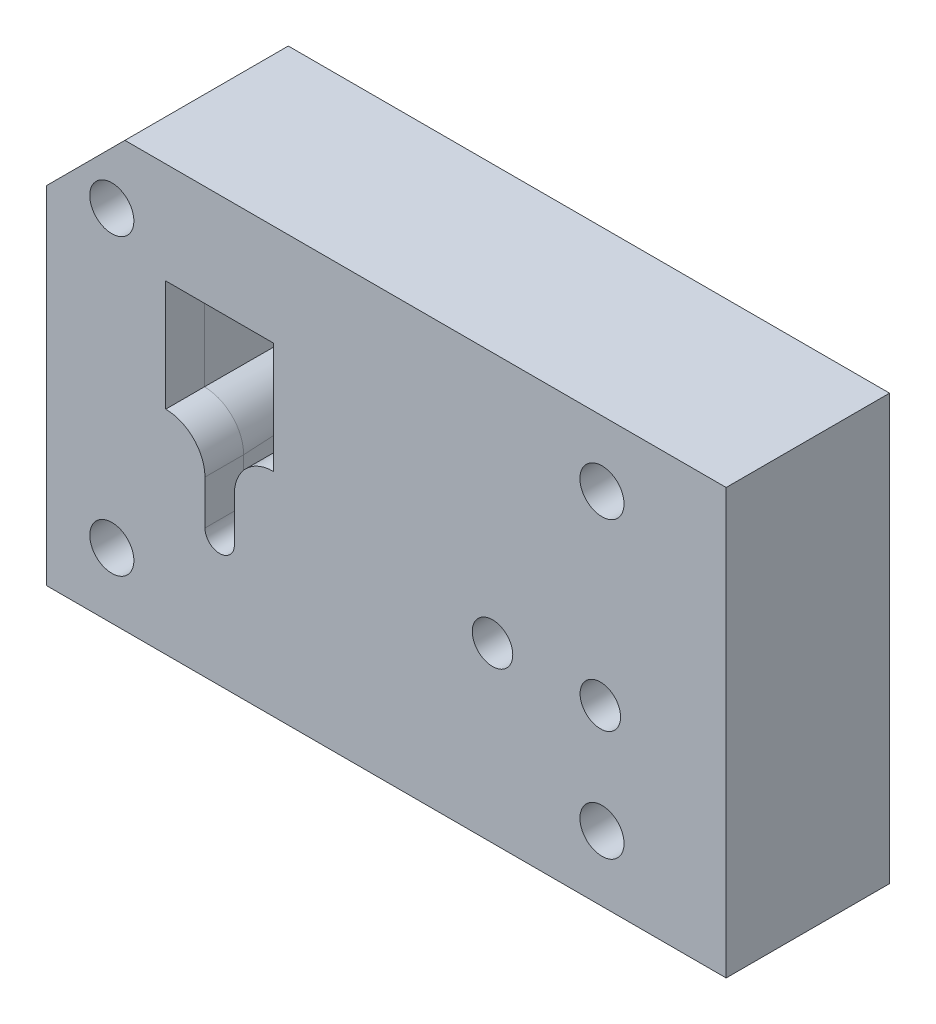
ISO-10303-21;
HEADER;
FILE_DESCRIPTION(('STEP AP214'),'2;1');
FILE_NAME('part.step','',(''),(''),'','','');
FILE_SCHEMA(('AUTOMOTIVE_DESIGN { 1 0 10303 214 1 1 1 1 }'));
ENDSEC;
DATA;
#1=APPLICATION_CONTEXT('core data for automotive mechanical design processes');
#2=APPLICATION_PROTOCOL_DEFINITION('international standard','automotive_design',2000,#1);
#3=PRODUCT_CONTEXT('',#1,'mechanical');
#4=PRODUCT('Part','Part','',(#3));
#5=PRODUCT_RELATED_PRODUCT_CATEGORY('part','',(#4));
#6=PRODUCT_DEFINITION_FORMATION('','',#4);
#7=PRODUCT_DEFINITION_CONTEXT('part definition',#1,'design');
#8=PRODUCT_DEFINITION('design','',#6,#7);
#9=PRODUCT_DEFINITION_SHAPE('','',#8);
#10=(LENGTH_UNIT() NAMED_UNIT(*) SI_UNIT(.MILLI.,.METRE.));
#11=(NAMED_UNIT(*) PLANE_ANGLE_UNIT() SI_UNIT($,.RADIAN.));
#12=(NAMED_UNIT(*) SI_UNIT($,.STERADIAN.) SOLID_ANGLE_UNIT());
#13=UNCERTAINTY_MEASURE_WITH_UNIT(LENGTH_MEASURE(1.E-05),#10,'distance_accuracy_value','');
#14=(GEOMETRIC_REPRESENTATION_CONTEXT(3) GLOBAL_UNCERTAINTY_ASSIGNED_CONTEXT((#13)) GLOBAL_UNIT_ASSIGNED_CONTEXT((#10,
#11,#12)) REPRESENTATION_CONTEXT('',''));
#15=CARTESIAN_POINT('',(0.,0.,0.));
#16=DIRECTION('',(0.,0.,1.));
#17=DIRECTION('',(1.,0.,0.));
#18=AXIS2_PLACEMENT_3D('',#15,#16,#17);
#19=CARTESIAN_POINT('',(205.,122.,25.));
#20=DIRECTION('',(0.,0.,1.));
#21=DIRECTION('',(1.,0.,0.));
#22=AXIS2_PLACEMENT_3D('',#19,#20,#21);
#23=PLANE('',#22);
#24=CARTESIAN_POINT('',(186.,132.,25.));
#25=DIRECTION('',(0.,0.,-1.));
#26=DIRECTION('',(-1.,0.,0.));
#27=AXIS2_PLACEMENT_3D('',#24,#25,#26);
#28=CIRCLE('',#27,3.375);
#29=CARTESIAN_POINT('',(182.625,132.,25.));
#30=VERTEX_POINT('',#29);
#31=EDGE_CURVE('E440',#30,#30,#28,.T.);
#32=ORIENTED_EDGE('',*,*,#31,.T.);
#33=EDGE_LOOP('',(#32));
#34=FACE_BOUND('',#33,.T.);
#35=CARTESIAN_POINT('',(186.,177.,25.));
#36=DIRECTION('',(0.,0.,-1.));
#37=DIRECTION('',(-1.,0.,0.));
#38=AXIS2_PLACEMENT_3D('',#35,#36,#37);
#39=CIRCLE('',#38,3.375);
#40=CARTESIAN_POINT('',(182.625,177.,25.));
#41=VERTEX_POINT('',#40);
#42=EDGE_CURVE('E450',#41,#41,#39,.T.);
#43=ORIENTED_EDGE('',*,*,#42,.T.);
#44=EDGE_LOOP('',(#43));
#45=FACE_BOUND('',#44,.T.);
#46=CARTESIAN_POINT('',(111.,132.,25.));
#47=DIRECTION('',(0.,0.,-1.));
#48=DIRECTION('',(-1.,0.,0.));
#49=AXIS2_PLACEMENT_3D('',#46,#47,#48);
#50=CIRCLE('',#49,3.375);
#51=CARTESIAN_POINT('',(107.625,132.,25.));
#52=VERTEX_POINT('',#51);
#53=EDGE_CURVE('E456',#52,#52,#50,.T.);
#54=ORIENTED_EDGE('',*,*,#53,.T.);
#55=EDGE_LOOP('',(#54));
#56=FACE_BOUND('',#55,.T.);
#57=CARTESIAN_POINT('',(111.,177.,25.));
#58=DIRECTION('',(0.,0.,-1.));
#59=DIRECTION('',(-1.,0.,0.));
#60=AXIS2_PLACEMENT_3D('',#57,#58,#59);
#61=CIRCLE('',#60,3.375);
#62=CARTESIAN_POINT('',(107.625,177.,25.));
#63=VERTEX_POINT('',#62);
#64=EDGE_CURVE('E462',#63,#63,#61,.T.);
#65=ORIENTED_EDGE('',*,*,#64,.T.);
#66=EDGE_LOOP('',(#65));
#67=FACE_BOUND('',#66,.T.);
#68=CARTESIAN_POINT('',(169.25,148.5,25.));
#69=DIRECTION('',(0.,0.,1.));
#70=DIRECTION('',(1.,0.,0.));
#71=AXIS2_PLACEMENT_3D('',#68,#69,#70);
#72=CIRCLE('',#71,3.10000000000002);
#73=CARTESIAN_POINT('',(172.35,148.5,25.));
#74=VERTEX_POINT('',#73);
#75=EDGE_CURVE('E279',#74,#74,#72,.T.);
#76=ORIENTED_EDGE('',*,*,#75,.F.);
#77=EDGE_LOOP('',(#76));
#78=FACE_BOUND('',#77,.T.);
#79=DIRECTION('',(0.,1.,0.));
#80=VECTOR('',#79,1.);
#81=CARTESIAN_POINT('',(205.,187.,25.));
#82=LINE('',#81,#80);
#83=CARTESIAN_POINT('',(205.,122.,25.));
#84=VERTEX_POINT('',#83);
#85=CARTESIAN_POINT('',(205.,187.,25.));
#86=VERTEX_POINT('',#85);
#87=EDGE_CURVE('E299',#84,#86,#82,.T.);
#88=ORIENTED_EDGE('',*,*,#87,.T.);
#89=DIRECTION('',(-1.,0.,0.));
#90=VECTOR('',#89,1.);
#91=CARTESIAN_POINT('',(205.,187.,25.));
#92=LINE('',#91,#90);
#93=CARTESIAN_POINT('',(113.,187.,25.));
#94=VERTEX_POINT('',#93);
#95=EDGE_CURVE('E302',#86,#94,#92,.T.);
#96=ORIENTED_EDGE('',*,*,#95,.T.);
#97=DIRECTION('',(-0.707106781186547,-0.707106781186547,0.));
#98=VECTOR('',#97,1.);
#99=CARTESIAN_POINT('',(113.,187.,25.));
#100=LINE('',#99,#98);
#101=CARTESIAN_POINT('',(101.,175.,25.));
#102=VERTEX_POINT('',#101);
#103=EDGE_CURVE('E304',#94,#102,#100,.T.);
#104=ORIENTED_EDGE('',*,*,#103,.T.);
#105=DIRECTION('',(0.,-1.,0.));
#106=VECTOR('',#105,1.);
#107=CARTESIAN_POINT('',(101.,175.,25.));
#108=LINE('',#107,#106);
#109=CARTESIAN_POINT('',(101.,122.,25.));
#110=VERTEX_POINT('',#109);
#111=EDGE_CURVE('E306',#102,#110,#108,.T.);
#112=ORIENTED_EDGE('',*,*,#111,.T.);
#113=DIRECTION('',(1.,0.,0.));
#114=VECTOR('',#113,1.);
#115=CARTESIAN_POINT('',(101.,122.,25.));
#116=LINE('',#115,#114);
#117=EDGE_CURVE('E308',#110,#84,#116,.T.);
#118=ORIENTED_EDGE('',*,*,#117,.T.);
#119=EDGE_LOOP('',(#88,#96,#104,#112,#118));
#120=FACE_BOUND('',#119,.T.);
#121=CARTESIAN_POINT('',(185.75,148.5,25.));
#122=DIRECTION('',(0.,0.,1.));
#123=DIRECTION('',(1.,0.,0.));
#124=AXIS2_PLACEMENT_3D('',#121,#122,#123);
#125=CIRCLE('',#124,3.09999999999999);
#126=CARTESIAN_POINT('',(188.85,148.5,25.));
#127=VERTEX_POINT('',#126);
#128=EDGE_CURVE('E285',#127,#127,#125,.T.);
#129=ORIENTED_EDGE('',*,*,#128,.F.);
#130=EDGE_LOOP('',(#129));
#131=FACE_BOUND('',#130,.T.);
#132=DIRECTION('',(0.,1.,0.));
#133=VECTOR('',#132,1.);
#134=CARTESIAN_POINT('',(135.75,154.5,25.));
#135=LINE('',#134,#133);
#136=CARTESIAN_POINT('',(135.75,154.5,25.));
#137=VERTEX_POINT('',#136);
#138=CARTESIAN_POINT('',(135.75,171.5,25.));
#139=VERTEX_POINT('',#138);
#140=EDGE_CURVE('E237',#137,#139,#135,.T.);
#141=ORIENTED_EDGE('',*,*,#140,.F.);
#142=CARTESIAN_POINT('',(135.75,148.5,25.));
#143=DIRECTION('',(0.,0.,-1.));
#144=DIRECTION('',(1.,0.,0.));
#145=AXIS2_PLACEMENT_3D('',#142,#143,#144);
#146=CIRCLE('',#145,6.00000000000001);
#147=CARTESIAN_POINT('',(129.75,148.5,25.));
#148=VERTEX_POINT('',#147);
#149=EDGE_CURVE('E235',#148,#137,#146,.T.);
#150=ORIENTED_EDGE('',*,*,#149,.F.);
#151=DIRECTION('',(0.,1.,0.));
#152=VECTOR('',#151,1.);
#153=CARTESIAN_POINT('',(129.75,148.5,25.));
#154=LINE('',#153,#152);
#155=CARTESIAN_POINT('',(129.75,141.75,25.));
#156=VERTEX_POINT('',#155);
#157=EDGE_CURVE('E250',#156,#148,#154,.T.);
#158=ORIENTED_EDGE('',*,*,#157,.F.);
#159=CARTESIAN_POINT('',(127.5,141.75,25.));
#160=DIRECTION('',(0.,0.,1.));
#161=DIRECTION('',(1.,0.,0.));
#162=AXIS2_PLACEMENT_3D('',#159,#160,#161);
#163=CIRCLE('',#162,2.25);
#164=CARTESIAN_POINT('',(125.25,141.75,25.));
#165=VERTEX_POINT('',#164);
#166=EDGE_CURVE('E247',#165,#156,#163,.T.);
#167=ORIENTED_EDGE('',*,*,#166,.F.);
#168=DIRECTION('',(0.,-1.,0.));
#169=VECTOR('',#168,1.);
#170=CARTESIAN_POINT('',(125.25,141.75,25.));
#171=LINE('',#170,#169);
#172=CARTESIAN_POINT('',(125.25,148.5,25.));
#173=VERTEX_POINT('',#172);
#174=EDGE_CURVE('E245',#173,#165,#171,.T.);
#175=ORIENTED_EDGE('',*,*,#174,.F.);
#176=CARTESIAN_POINT('',(119.25,148.5,25.));
#177=DIRECTION('',(0.,0.,-1.));
#178=DIRECTION('',(1.,0.,0.));
#179=AXIS2_PLACEMENT_3D('',#176,#177,#178);
#180=CIRCLE('',#179,5.99999999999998);
#181=CARTESIAN_POINT('',(119.25,154.5,25.));
#182=VERTEX_POINT('',#181);
#183=EDGE_CURVE('E243',#182,#173,#180,.T.);
#184=ORIENTED_EDGE('',*,*,#183,.F.);
#185=DIRECTION('',(0.,-1.,0.));
#186=VECTOR('',#185,1.);
#187=CARTESIAN_POINT('',(119.25,171.5,25.));
#188=LINE('',#187,#186);
#189=CARTESIAN_POINT('',(119.25,171.5,25.));
#190=VERTEX_POINT('',#189);
#191=EDGE_CURVE('E241',#190,#182,#188,.T.);
#192=ORIENTED_EDGE('',*,*,#191,.F.);
#193=DIRECTION('',(-1.,0.,0.));
#194=VECTOR('',#193,1.);
#195=CARTESIAN_POINT('',(135.75,171.5,25.));
#196=LINE('',#195,#194);
#197=EDGE_CURVE('E239',#139,#190,#196,.T.);
#198=ORIENTED_EDGE('',*,*,#197,.F.);
#199=EDGE_LOOP('',(#141,#150,#158,#167,#175,#184,#192,#198));
#200=FACE_BOUND('',#199,.T.);
#201=ADVANCED_FACE('F31',(#34,#45,#56,#67,#78,#120,#131,#200),#23,.T.);
#202=CARTESIAN_POINT('',(205.,122.,0.));
#203=DIRECTION('',(0.,0.,1.));
#204=DIRECTION('',(1.,0.,0.));
#205=AXIS2_PLACEMENT_3D('',#202,#203,#204);
#206=PLANE('',#205);
#207=CARTESIAN_POINT('',(186.,132.,0.));
#208=DIRECTION('',(0.,0.,-1.));
#209=DIRECTION('',(-1.,0.,0.));
#210=AXIS2_PLACEMENT_3D('',#207,#208,#209);
#211=CIRCLE('',#210,3.375);
#212=CARTESIAN_POINT('',(182.625,132.,0.));
#213=VERTEX_POINT('',#212);
#214=EDGE_CURVE('E443',#213,#213,#211,.T.);
#215=ORIENTED_EDGE('',*,*,#214,.F.);
#216=EDGE_LOOP('',(#215));
#217=FACE_BOUND('',#216,.T.);
#218=CARTESIAN_POINT('',(186.,177.,0.));
#219=DIRECTION('',(0.,0.,-1.));
#220=DIRECTION('',(-1.,0.,0.));
#221=AXIS2_PLACEMENT_3D('',#218,#219,#220);
#222=CIRCLE('',#221,3.375);
#223=CARTESIAN_POINT('',(182.625,177.,0.));
#224=VERTEX_POINT('',#223);
#225=EDGE_CURVE('E445',#224,#224,#222,.T.);
#226=ORIENTED_EDGE('',*,*,#225,.F.);
#227=EDGE_LOOP('',(#226));
#228=FACE_BOUND('',#227,.T.);
#229=CARTESIAN_POINT('',(111.,132.,0.));
#230=DIRECTION('',(0.,0.,-1.));
#231=DIRECTION('',(-1.,0.,0.));
#232=AXIS2_PLACEMENT_3D('',#229,#230,#231);
#233=CIRCLE('',#232,3.375);
#234=CARTESIAN_POINT('',(107.625,132.,0.));
#235=VERTEX_POINT('',#234);
#236=EDGE_CURVE('E453',#235,#235,#233,.T.);
#237=ORIENTED_EDGE('',*,*,#236,.F.);
#238=EDGE_LOOP('',(#237));
#239=FACE_BOUND('',#238,.T.);
#240=CARTESIAN_POINT('',(111.,177.,0.));
#241=DIRECTION('',(0.,0.,-1.));
#242=DIRECTION('',(-1.,0.,0.));
#243=AXIS2_PLACEMENT_3D('',#240,#241,#242);
#244=CIRCLE('',#243,3.375);
#245=CARTESIAN_POINT('',(107.625,177.,0.));
#246=VERTEX_POINT('',#245);
#247=EDGE_CURVE('E459',#246,#246,#244,.T.);
#248=ORIENTED_EDGE('',*,*,#247,.F.);
#249=EDGE_LOOP('',(#248));
#250=FACE_BOUND('',#249,.T.);
#251=DIRECTION('',(1.,0.,0.));
#252=VECTOR('',#251,1.);
#253=CARTESIAN_POINT('',(118.25,172.5,0.));
#254=LINE('',#253,#252);
#255=CARTESIAN_POINT('',(118.25,172.5,0.));
#256=VERTEX_POINT('',#255);
#257=CARTESIAN_POINT('',(136.75,172.5,0.));
#258=VERTEX_POINT('',#257);
#259=EDGE_CURVE('E165',#256,#258,#254,.T.);
#260=ORIENTED_EDGE('',*,*,#259,.F.);
#261=DIRECTION('',(0.,1.,0.));
#262=VECTOR('',#261,1.);
#263=CARTESIAN_POINT('',(118.25,153.398979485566,0.));
#264=LINE('',#263,#262);
#265=CARTESIAN_POINT('',(118.25,153.398979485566,0.));
#266=VERTEX_POINT('',#265);
#267=EDGE_CURVE('E46',#266,#256,#264,.T.);
#268=ORIENTED_EDGE('',*,*,#267,.F.);
#269=CARTESIAN_POINT('',(119.25,148.5,0.));
#270=DIRECTION('',(0.,0.,1.));
#271=DIRECTION('',(-1.,0.,0.));
#272=AXIS2_PLACEMENT_3D('',#269,#270,#271);
#273=CIRCLE('',#272,4.99999999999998);
#274=CARTESIAN_POINT('',(124.25,148.5,0.));
#275=VERTEX_POINT('',#274);
#276=EDGE_CURVE('E186',#275,#266,#273,.T.);
#277=ORIENTED_EDGE('',*,*,#276,.F.);
#278=DIRECTION('',(0.,1.,0.));
#279=VECTOR('',#278,1.);
#280=CARTESIAN_POINT('',(124.25,141.75,0.));
#281=LINE('',#280,#279);
#282=CARTESIAN_POINT('',(124.25,141.75,0.));
#283=VERTEX_POINT('',#282);
#284=EDGE_CURVE('E183',#283,#275,#281,.T.);
#285=ORIENTED_EDGE('',*,*,#284,.F.);
#286=CARTESIAN_POINT('',(127.5,141.75,0.));
#287=DIRECTION('',(0.,0.,-1.));
#288=DIRECTION('',(-1.,0.,0.));
#289=AXIS2_PLACEMENT_3D('',#286,#287,#288);
#290=CIRCLE('',#289,3.25000000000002);
#291=CARTESIAN_POINT('',(130.75,141.75,0.));
#292=VERTEX_POINT('',#291);
#293=EDGE_CURVE('E180',#292,#283,#290,.T.);
#294=ORIENTED_EDGE('',*,*,#293,.F.);
#295=DIRECTION('',(0.,-1.,0.));
#296=VECTOR('',#295,1.);
#297=CARTESIAN_POINT('',(130.75,148.5,0.));
#298=LINE('',#297,#296);
#299=CARTESIAN_POINT('',(130.75,148.5,0.));
#300=VERTEX_POINT('',#299);
#301=EDGE_CURVE('E175',#300,#292,#298,.T.);
#302=ORIENTED_EDGE('',*,*,#301,.F.);
#303=CARTESIAN_POINT('',(135.75,148.5,0.));
#304=DIRECTION('',(0.,0.,1.));
#305=DIRECTION('',(-1.,0.,0.));
#306=AXIS2_PLACEMENT_3D('',#303,#304,#305);
#307=CIRCLE('',#306,4.99999999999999);
#308=CARTESIAN_POINT('',(136.75,153.398979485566,0.));
#309=VERTEX_POINT('',#308);
#310=EDGE_CURVE('E173',#309,#300,#307,.T.);
#311=ORIENTED_EDGE('',*,*,#310,.F.);
#312=DIRECTION('',(0.,-1.,0.));
#313=VECTOR('',#312,1.);
#314=CARTESIAN_POINT('',(136.75,172.5,0.));
#315=LINE('',#314,#313);
#316=EDGE_CURVE('E155',#258,#309,#315,.T.);
#317=ORIENTED_EDGE('',*,*,#316,.F.);
#318=EDGE_LOOP('',(#260,#268,#277,#285,#294,#302,#311,#317));
#319=FACE_BOUND('',#318,.T.);
#320=CARTESIAN_POINT('',(169.25,148.5,0.));
#321=DIRECTION('',(0.,0.,1.));
#322=DIRECTION('',(1.,0.,0.));
#323=AXIS2_PLACEMENT_3D('',#320,#321,#322);
#324=CIRCLE('',#323,3.10000000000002);
#325=CARTESIAN_POINT('',(172.35,148.5,0.));
#326=VERTEX_POINT('',#325);
#327=EDGE_CURVE('E276',#326,#326,#324,.T.);
#328=ORIENTED_EDGE('',*,*,#327,.T.);
#329=EDGE_LOOP('',(#328));
#330=FACE_BOUND('',#329,.T.);
#331=DIRECTION('',(0.,1.,0.));
#332=VECTOR('',#331,1.);
#333=CARTESIAN_POINT('',(205.,187.,0.));
#334=LINE('',#333,#332);
#335=CARTESIAN_POINT('',(205.,122.,0.));
#336=VERTEX_POINT('',#335);
#337=CARTESIAN_POINT('',(205.,187.,0.));
#338=VERTEX_POINT('',#337);
#339=EDGE_CURVE('E288',#336,#338,#334,.T.);
#340=ORIENTED_EDGE('',*,*,#339,.F.);
#341=DIRECTION('',(1.,0.,0.));
#342=VECTOR('',#341,1.);
#343=CARTESIAN_POINT('',(101.,122.,0.));
#344=LINE('',#343,#342);
#345=CARTESIAN_POINT('',(101.,122.,0.));
#346=VERTEX_POINT('',#345);
#347=EDGE_CURVE('E297',#346,#336,#344,.T.);
#348=ORIENTED_EDGE('',*,*,#347,.F.);
#349=DIRECTION('',(0.,-1.,0.));
#350=VECTOR('',#349,1.);
#351=CARTESIAN_POINT('',(101.,175.,0.));
#352=LINE('',#351,#350);
#353=CARTESIAN_POINT('',(101.,175.,0.));
#354=VERTEX_POINT('',#353);
#355=EDGE_CURVE('E295',#354,#346,#352,.T.);
#356=ORIENTED_EDGE('',*,*,#355,.F.);
#357=DIRECTION('',(-0.707106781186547,-0.707106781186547,0.));
#358=VECTOR('',#357,1.);
#359=CARTESIAN_POINT('',(113.,187.,0.));
#360=LINE('',#359,#358);
#361=CARTESIAN_POINT('',(113.,187.,0.));
#362=VERTEX_POINT('',#361);
#363=EDGE_CURVE('E293',#362,#354,#360,.T.);
#364=ORIENTED_EDGE('',*,*,#363,.F.);
#365=DIRECTION('',(-1.,0.,0.));
#366=VECTOR('',#365,1.);
#367=CARTESIAN_POINT('',(205.,187.,0.));
#368=LINE('',#367,#366);
#369=EDGE_CURVE('E291',#338,#362,#368,.T.);
#370=ORIENTED_EDGE('',*,*,#369,.F.);
#371=EDGE_LOOP('',(#340,#348,#356,#364,#370));
#372=FACE_BOUND('',#371,.T.);
#373=CARTESIAN_POINT('',(185.75,148.5,0.));
#374=DIRECTION('',(0.,0.,1.));
#375=DIRECTION('',(1.,0.,0.));
#376=AXIS2_PLACEMENT_3D('',#373,#374,#375);
#377=CIRCLE('',#376,3.09999999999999);
#378=CARTESIAN_POINT('',(188.85,148.5,0.));
#379=VERTEX_POINT('',#378);
#380=EDGE_CURVE('E282',#379,#379,#377,.T.);
#381=ORIENTED_EDGE('',*,*,#380,.T.);
#382=EDGE_LOOP('',(#381));
#383=FACE_BOUND('',#382,.T.);
#384=ADVANCED_FACE('F169',(#217,#228,#239,#250,#319,#330,#372,#383),#206,.F.);
#385=CARTESIAN_POINT('',(205.,187.,25.));
#386=DIRECTION('',(-1.,0.,0.));
#387=DIRECTION('',(0.,0.,1.));
#388=AXIS2_PLACEMENT_3D('',#385,#386,#387);
#389=PLANE('',#388);
#390=ORIENTED_EDGE('',*,*,#339,.T.);
#391=DIRECTION('',(0.,0.,-1.));
#392=VECTOR('',#391,1.);
#393=CARTESIAN_POINT('',(205.,187.,25.));
#394=LINE('',#393,#392);
#395=EDGE_CURVE('E39',#86,#338,#394,.T.);
#396=ORIENTED_EDGE('',*,*,#395,.F.);
#397=ORIENTED_EDGE('',*,*,#87,.F.);
#398=DIRECTION('',(0.,0.,-1.));
#399=VECTOR('',#398,1.);
#400=CARTESIAN_POINT('',(205.,122.,25.));
#401=LINE('',#400,#399);
#402=EDGE_CURVE('E310',#84,#336,#401,.T.);
#403=ORIENTED_EDGE('',*,*,#402,.T.);
#404=EDGE_LOOP('',(#390,#396,#397,#403));
#405=FACE_BOUND('',#404,.T.);
#406=ADVANCED_FACE('F33',(#405),#389,.F.);
#407=CARTESIAN_POINT('',(205.,187.,25.));
#408=DIRECTION('',(0.,-1.,0.));
#409=DIRECTION('',(0.,0.,-1.));
#410=AXIS2_PLACEMENT_3D('',#407,#408,#409);
#411=PLANE('',#410);
#412=ORIENTED_EDGE('',*,*,#369,.T.);
#413=DIRECTION('',(0.,0.,-1.));
#414=VECTOR('',#413,1.);
#415=CARTESIAN_POINT('',(113.,187.,25.));
#416=LINE('',#415,#414);
#417=EDGE_CURVE('E319',#94,#362,#416,.T.);
#418=ORIENTED_EDGE('',*,*,#417,.F.);
#419=ORIENTED_EDGE('',*,*,#95,.F.);
#420=ORIENTED_EDGE('',*,*,#395,.T.);
#421=EDGE_LOOP('',(#412,#418,#419,#420));
#422=FACE_BOUND('',#421,.T.);
#423=ADVANCED_FACE('F324',(#422),#411,.F.);
#424=CARTESIAN_POINT('',(113.,187.,25.));
#425=DIRECTION('',(0.707106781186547,-0.707106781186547,0.));
#426=DIRECTION('',(0.707106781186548,0.707106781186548,0.));
#427=AXIS2_PLACEMENT_3D('',#424,#425,#426);
#428=PLANE('',#427);
#429=ORIENTED_EDGE('',*,*,#363,.T.);
#430=DIRECTION('',(0.,0.,-1.));
#431=VECTOR('',#430,1.);
#432=CARTESIAN_POINT('',(101.,175.,25.));
#433=LINE('',#432,#431);
#434=EDGE_CURVE('E316',#102,#354,#433,.T.);
#435=ORIENTED_EDGE('',*,*,#434,.F.);
#436=ORIENTED_EDGE('',*,*,#103,.F.);
#437=ORIENTED_EDGE('',*,*,#417,.T.);
#438=EDGE_LOOP('',(#429,#435,#436,#437));
#439=FACE_BOUND('',#438,.T.);
#440=ADVANCED_FACE('F337',(#439),#428,.F.);
#441=CARTESIAN_POINT('',(101.,175.,25.));
#442=DIRECTION('',(1.,0.,0.));
#443=DIRECTION('',(0.,0.,-1.));
#444=AXIS2_PLACEMENT_3D('',#441,#442,#443);
#445=PLANE('',#444);
#446=ORIENTED_EDGE('',*,*,#355,.T.);
#447=DIRECTION('',(0.,0.,-1.));
#448=VECTOR('',#447,1.);
#449=CARTESIAN_POINT('',(101.,122.,25.));
#450=LINE('',#449,#448);
#451=EDGE_CURVE('E313',#110,#346,#450,.T.);
#452=ORIENTED_EDGE('',*,*,#451,.F.);
#453=ORIENTED_EDGE('',*,*,#111,.F.);
#454=ORIENTED_EDGE('',*,*,#434,.T.);
#455=EDGE_LOOP('',(#446,#452,#453,#454));
#456=FACE_BOUND('',#455,.T.);
#457=ADVANCED_FACE('F341',(#456),#445,.F.);
#458=CARTESIAN_POINT('',(101.,122.,25.));
#459=DIRECTION('',(0.,1.,0.));
#460=DIRECTION('',(0.,0.,1.));
#461=AXIS2_PLACEMENT_3D('',#458,#459,#460);
#462=PLANE('',#461);
#463=ORIENTED_EDGE('',*,*,#347,.T.);
#464=ORIENTED_EDGE('',*,*,#402,.F.);
#465=ORIENTED_EDGE('',*,*,#117,.F.);
#466=ORIENTED_EDGE('',*,*,#451,.T.);
#467=EDGE_LOOP('',(#463,#464,#465,#466));
#468=FACE_BOUND('',#467,.T.);
#469=ADVANCED_FACE('F347',(#468),#462,.F.);
#470=CARTESIAN_POINT('',(185.75,148.5,25.));
#471=DIRECTION('',(0.,0.,-1.));
#472=DIRECTION('',(-1.,0.,0.));
#473=AXIS2_PLACEMENT_3D('',#470,#471,#472);
#474=CYLINDRICAL_SURFACE('',#473,3.09999999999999);
#475=ORIENTED_EDGE('',*,*,#128,.T.);
#476=EDGE_LOOP('',(#475));
#477=FACE_BOUND('',#476,.T.);
#478=ORIENTED_EDGE('',*,*,#380,.F.);
#479=EDGE_LOOP('',(#478));
#480=FACE_BOUND('',#479,.T.);
#481=ADVANCED_FACE('F349',(#477,#480),#474,.F.);
#482=CARTESIAN_POINT('',(169.25,148.5,25.));
#483=DIRECTION('',(0.,0.,-1.));
#484=DIRECTION('',(-1.,0.,0.));
#485=AXIS2_PLACEMENT_3D('',#482,#483,#484);
#486=CYLINDRICAL_SURFACE('',#485,3.10000000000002);
#487=ORIENTED_EDGE('',*,*,#75,.T.);
#488=EDGE_LOOP('',(#487));
#489=FACE_BOUND('',#488,.T.);
#490=ORIENTED_EDGE('',*,*,#327,.F.);
#491=EDGE_LOOP('',(#490));
#492=FACE_BOUND('',#491,.T.);
#493=ADVANCED_FACE('F355',(#489,#492),#486,.F.);
#494=CARTESIAN_POINT('',(135.75,148.5,25.));
#495=DIRECTION('',(0.,0.,-1.));
#496=DIRECTION('',(-1.,0.,0.));
#497=AXIS2_PLACEMENT_3D('',#494,#495,#496);
#498=CYLINDRICAL_SURFACE('',#497,6.00000000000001);
#499=CARTESIAN_POINT('',(135.75,148.5,19.0811366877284));
#500=DIRECTION('',(0.,0.,1.));
#501=DIRECTION('',(1.,0.,0.));
#502=AXIS2_PLACEMENT_3D('',#499,#500,#501);
#503=CIRCLE('',#502,6.00000000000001);
#504=CARTESIAN_POINT('',(129.75,148.5,19.0811366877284));
#505=VERTEX_POINT('',#504);
#506=CARTESIAN_POINT('',(135.75,154.5,19.0811366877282));
#507=VERTEX_POINT('',#506);
#508=EDGE_CURVE('E196',#505,#507,#503,.F.);
#509=ORIENTED_EDGE('',*,*,#508,.F.);
#510=DIRECTION('',(0.,0.,-1.));
#511=VECTOR('',#510,1.);
#512=CARTESIAN_POINT('',(129.75,148.5,25.));
#513=LINE('',#512,#511);
#514=EDGE_CURVE('E252',#148,#505,#513,.T.);
#515=ORIENTED_EDGE('',*,*,#514,.F.);
#516=ORIENTED_EDGE('',*,*,#149,.T.);
#517=DIRECTION('',(0.,0.,-1.));
#518=VECTOR('',#517,1.);
#519=CARTESIAN_POINT('',(135.75,154.5,25.));
#520=LINE('',#519,#518);
#521=EDGE_CURVE('E273',#137,#507,#520,.T.);
#522=ORIENTED_EDGE('',*,*,#521,.T.);
#523=EDGE_LOOP('',(#509,#515,#516,#522));
#524=FACE_BOUND('',#523,.T.);
#525=ADVANCED_FACE('F372',(#524),#498,.T.);
#526=CARTESIAN_POINT('',(135.75,154.5,25.));
#527=DIRECTION('',(-1.,0.,0.));
#528=DIRECTION('',(0.,0.,1.));
#529=AXIS2_PLACEMENT_3D('',#526,#527,#528);
#530=PLANE('',#529);
#531=DIRECTION('',(0.,1.,0.));
#532=VECTOR('',#531,1.);
#533=CARTESIAN_POINT('',(135.75,154.5,19.0811366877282));
#534=LINE('',#533,#532);
#535=CARTESIAN_POINT('',(135.75,171.5,19.0811366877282));
#536=VERTEX_POINT('',#535);
#537=EDGE_CURVE('E158',#507,#536,#534,.T.);
#538=ORIENTED_EDGE('',*,*,#537,.F.);
#539=ORIENTED_EDGE('',*,*,#521,.F.);
#540=ORIENTED_EDGE('',*,*,#140,.T.);
#541=DIRECTION('',(0.,0.,-1.));
#542=VECTOR('',#541,1.);
#543=CARTESIAN_POINT('',(135.75,171.5,25.));
#544=LINE('',#543,#542);
#545=EDGE_CURVE('E270',#139,#536,#544,.T.);
#546=ORIENTED_EDGE('',*,*,#545,.T.);
#547=EDGE_LOOP('',(#538,#539,#540,#546));
#548=FACE_BOUND('',#547,.T.);
#549=ADVANCED_FACE('F376',(#548),#530,.T.);
#550=CARTESIAN_POINT('',(135.75,171.5,25.));
#551=DIRECTION('',(0.,-1.,0.));
#552=DIRECTION('',(0.,0.,-1.));
#553=AXIS2_PLACEMENT_3D('',#550,#551,#552);
#554=PLANE('',#553);
#555=DIRECTION('',(-1.,0.,0.));
#556=VECTOR('',#555,1.);
#557=CARTESIAN_POINT('',(135.75,171.5,19.0811366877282));
#558=LINE('',#557,#556);
#559=CARTESIAN_POINT('',(119.25,171.5,19.081136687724));
#560=VERTEX_POINT('',#559);
#561=EDGE_CURVE('E232',#536,#560,#558,.T.);
#562=ORIENTED_EDGE('',*,*,#561,.F.);
#563=ORIENTED_EDGE('',*,*,#545,.F.);
#564=ORIENTED_EDGE('',*,*,#197,.T.);
#565=DIRECTION('',(0.,0.,-1.));
#566=VECTOR('',#565,1.);
#567=CARTESIAN_POINT('',(119.25,171.5,25.));
#568=LINE('',#567,#566);
#569=EDGE_CURVE('E267',#190,#560,#568,.T.);
#570=ORIENTED_EDGE('',*,*,#569,.T.);
#571=EDGE_LOOP('',(#562,#563,#564,#570));
#572=FACE_BOUND('',#571,.T.);
#573=ADVANCED_FACE('F380',(#572),#554,.T.);
#574=CARTESIAN_POINT('',(119.25,171.5,25.));
#575=DIRECTION('',(1.,0.,0.));
#576=DIRECTION('',(0.,0.,-1.));
#577=AXIS2_PLACEMENT_3D('',#574,#575,#576);
#578=PLANE('',#577);
#579=DIRECTION('',(0.,-1.,0.));
#580=VECTOR('',#579,1.);
#581=CARTESIAN_POINT('',(119.25,171.5,19.0811366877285));
#582=LINE('',#581,#580);
#583=CARTESIAN_POINT('',(119.25,154.5,19.0811366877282));
#584=VERTEX_POINT('',#583);
#585=EDGE_CURVE('E230',#560,#584,#582,.T.);
#586=ORIENTED_EDGE('',*,*,#585,.F.);
#587=ORIENTED_EDGE('',*,*,#569,.F.);
#588=ORIENTED_EDGE('',*,*,#191,.T.);
#589=DIRECTION('',(0.,0.,-1.));
#590=VECTOR('',#589,1.);
#591=CARTESIAN_POINT('',(119.25,154.5,25.));
#592=LINE('',#591,#590);
#593=EDGE_CURVE('E264',#182,#584,#592,.T.);
#594=ORIENTED_EDGE('',*,*,#593,.T.);
#595=EDGE_LOOP('',(#586,#587,#588,#594));
#596=FACE_BOUND('',#595,.T.);
#597=ADVANCED_FACE('F384',(#596),#578,.T.);
#598=CARTESIAN_POINT('',(119.25,148.5,25.));
#599=DIRECTION('',(0.,0.,-1.));
#600=DIRECTION('',(-1.,0.,0.));
#601=AXIS2_PLACEMENT_3D('',#598,#599,#600);
#602=CYLINDRICAL_SURFACE('',#601,5.99999999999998);
#603=CARTESIAN_POINT('',(119.25,148.5,19.0811366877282));
#604=DIRECTION('',(0.,0.,1.));
#605=DIRECTION('',(1.,0.,0.));
#606=AXIS2_PLACEMENT_3D('',#603,#604,#605);
#607=CIRCLE('',#606,5.99999999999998);
#608=CARTESIAN_POINT('',(125.25,148.5,19.0811366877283));
#609=VERTEX_POINT('',#608);
#610=EDGE_CURVE('E228',#584,#609,#607,.F.);
#611=ORIENTED_EDGE('',*,*,#610,.F.);
#612=ORIENTED_EDGE('',*,*,#593,.F.);
#613=ORIENTED_EDGE('',*,*,#183,.T.);
#614=DIRECTION('',(0.,0.,-1.));
#615=VECTOR('',#614,1.);
#616=CARTESIAN_POINT('',(125.25,148.5,25.));
#617=LINE('',#616,#615);
#618=EDGE_CURVE('E261',#173,#609,#617,.T.);
#619=ORIENTED_EDGE('',*,*,#618,.T.);
#620=EDGE_LOOP('',(#611,#612,#613,#619));
#621=FACE_BOUND('',#620,.T.);
#622=ADVANCED_FACE('F388',(#621),#602,.T.);
#623=CARTESIAN_POINT('',(125.25,141.75,25.));
#624=DIRECTION('',(1.,0.,0.));
#625=DIRECTION('',(0.,0.,-1.));
#626=AXIS2_PLACEMENT_3D('',#623,#624,#625);
#627=PLANE('',#626);
#628=DIRECTION('',(0.,-1.,0.));
#629=VECTOR('',#628,1.);
#630=CARTESIAN_POINT('',(125.25,141.75,19.0811366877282));
#631=LINE('',#630,#629);
#632=CARTESIAN_POINT('',(125.25,141.75,19.0811366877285));
#633=VERTEX_POINT('',#632);
#634=EDGE_CURVE('E226',#609,#633,#631,.T.);
#635=ORIENTED_EDGE('',*,*,#634,.F.);
#636=ORIENTED_EDGE('',*,*,#618,.F.);
#637=ORIENTED_EDGE('',*,*,#174,.T.);
#638=DIRECTION('',(0.,0.,-1.));
#639=VECTOR('',#638,1.);
#640=CARTESIAN_POINT('',(125.25,141.75,25.));
#641=LINE('',#640,#639);
#642=EDGE_CURVE('E258',#165,#633,#641,.T.);
#643=ORIENTED_EDGE('',*,*,#642,.T.);
#644=EDGE_LOOP('',(#635,#636,#637,#643));
#645=FACE_BOUND('',#644,.T.);
#646=ADVANCED_FACE('F392',(#645),#627,.T.);
#647=CARTESIAN_POINT('',(127.5,141.75,25.));
#648=DIRECTION('',(0.,0.,-1.));
#649=DIRECTION('',(-1.,0.,0.));
#650=AXIS2_PLACEMENT_3D('',#647,#648,#649);
#651=CYLINDRICAL_SURFACE('',#650,2.25);
#652=CARTESIAN_POINT('',(127.5,141.75,19.0811366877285));
#653=DIRECTION('',(0.,0.,-1.));
#654=DIRECTION('',(-1.,0.,0.));
#655=AXIS2_PLACEMENT_3D('',#652,#653,#654);
#656=CIRCLE('',#655,2.25);
#657=CARTESIAN_POINT('',(129.75,141.75,19.0811366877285));
#658=VERTEX_POINT('',#657);
#659=EDGE_CURVE('E224',#633,#658,#656,.F.);
#660=ORIENTED_EDGE('',*,*,#659,.F.);
#661=ORIENTED_EDGE('',*,*,#642,.F.);
#662=ORIENTED_EDGE('',*,*,#166,.T.);
#663=DIRECTION('',(0.,0.,-1.));
#664=VECTOR('',#663,1.);
#665=CARTESIAN_POINT('',(129.75,141.75,25.));
#666=LINE('',#665,#664);
#667=EDGE_CURVE('E255',#156,#658,#666,.T.);
#668=ORIENTED_EDGE('',*,*,#667,.T.);
#669=EDGE_LOOP('',(#660,#661,#662,#668));
#670=FACE_BOUND('',#669,.T.);
#671=ADVANCED_FACE('F396',(#670),#651,.F.);
#672=CARTESIAN_POINT('',(129.75,148.5,25.));
#673=DIRECTION('',(-1.,0.,0.));
#674=DIRECTION('',(0.,0.,1.));
#675=AXIS2_PLACEMENT_3D('',#672,#673,#674);
#676=PLANE('',#675);
#677=DIRECTION('',(0.,1.,0.));
#678=VECTOR('',#677,1.);
#679=CARTESIAN_POINT('',(129.75,148.499999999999,19.0811366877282));
#680=LINE('',#679,#678);
#681=EDGE_CURVE('E11',#658,#505,#680,.T.);
#682=ORIENTED_EDGE('',*,*,#681,.F.);
#683=ORIENTED_EDGE('',*,*,#667,.F.);
#684=ORIENTED_EDGE('',*,*,#157,.T.);
#685=ORIENTED_EDGE('',*,*,#514,.T.);
#686=EDGE_LOOP('',(#682,#683,#684,#685));
#687=FACE_BOUND('',#686,.T.);
#688=ADVANCED_FACE('F205',(#687),#676,.T.);
#689=CARTESIAN_POINT('',(118.25,153.398979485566,0.));
#690=DIRECTION('',(-0.998629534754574,0.,0.0523359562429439));
#691=DIRECTION('',(0.052335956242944,0.,0.998629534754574));
#692=AXIS2_PLACEMENT_3D('',#689,#690,#691);
#693=PLANE('',#692);
#694=ORIENTED_EDGE('',*,*,#585,.T.);
#695=CARTESIAN_POINT('',(119.560194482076,154.80256565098,25.));
#696=CARTESIAN_POINT('',(119.455714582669,154.703063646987,23.0064047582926));
#697=CARTESIAN_POINT('',(119.351240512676,154.601285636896,21.0129207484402));
#698=CARTESIAN_POINT('',(119.142308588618,154.39226172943,17.026262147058));
#699=CARTESIAN_POINT('',(119.037850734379,154.285015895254,15.0330875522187));
#700=CARTESIAN_POINT('',(118.819475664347,154.054116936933,10.8662429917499));
#701=CARTESIAN_POINT('',(118.705560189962,153.929858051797,8.69260625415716));
#702=CARTESIAN_POINT('',(118.534707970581,153.73647243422,5.43255170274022));
#703=CARTESIAN_POINT('',(118.477760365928,153.670843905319,4.34592667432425));
#704=CARTESIAN_POINT('',(118.363873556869,153.536957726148,2.17283690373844));
#705=CARTESIAN_POINT('',(118.306934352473,153.468700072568,1.08637216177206));
#706=CARTESIAN_POINT('',(118.25,153.398979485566,0.));
#707=B_SPLINE_CURVE_WITH_KNOTS('',3,(#695,#696,#697,#698,#699,#700,#701,#702,#703,#704,#705,
#706),.UNSPECIFIED.,.F.,.F.,(4,2,2,2,2,4),(0.,5.99642941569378,11.9927895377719,
18.5332620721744,21.8035401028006,25.0738222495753),.UNSPECIFIED.);
#708=EDGE_CURVE('E189',#584,#266,#707,.T.);
#709=ORIENTED_EDGE('',*,*,#708,.T.);
#710=ORIENTED_EDGE('',*,*,#267,.T.);
#711=DIRECTION('',(-0.052264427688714,0.052264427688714,-0.997264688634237));
#712=VECTOR('',#711,1.);
#713=CARTESIAN_POINT('',(118.302175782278,172.447824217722,0.995573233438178));
#714=LINE('',#713,#712);
#715=EDGE_CURVE('E162',#560,#256,#714,.T.);
#716=ORIENTED_EDGE('',*,*,#715,.F.);
#717=EDGE_LOOP('',(#694,#709,#710,#716));
#718=FACE_BOUND('',#717,.T.);
#719=ADVANCED_FACE('F201',(#718),#693,.F.);
#720=CARTESIAN_POINT('',(119.25,148.5,0.));
#721=DIRECTION('',(0.,0.,1.));
#722=DIRECTION('',(-1.,0.,0.));
#723=AXIS2_PLACEMENT_3D('',#720,#721,#722);
#724=CONICAL_SURFACE('',#723,4.99999999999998,0.05235987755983);
#725=ORIENTED_EDGE('',*,*,#610,.T.);
#726=DIRECTION('',(-0.0523359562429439,0.,-0.998629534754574));
#727=VECTOR('',#726,1.);
#728=CARTESIAN_POINT('',(124.25,148.5,0.));
#729=LINE('',#728,#727);
#730=EDGE_CURVE('E197',#609,#275,#729,.T.);
#731=ORIENTED_EDGE('',*,*,#730,.T.);
#732=ORIENTED_EDGE('',*,*,#276,.T.);
#733=ORIENTED_EDGE('',*,*,#708,.F.);
#734=EDGE_LOOP('',(#725,#731,#732,#733));
#735=FACE_BOUND('',#734,.T.);
#736=ADVANCED_FACE('F198',(#735),#724,.T.);
#737=CARTESIAN_POINT('',(124.25,141.75,0.));
#738=DIRECTION('',(-0.998629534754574,0.,0.0523359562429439));
#739=DIRECTION('',(0.052335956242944,0.,0.998629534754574));
#740=AXIS2_PLACEMENT_3D('',#737,#738,#739);
#741=PLANE('',#740);
#742=ORIENTED_EDGE('',*,*,#634,.T.);
#743=DIRECTION('',(-0.0523359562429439,0.,-0.998629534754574));
#744=VECTOR('',#743,1.);
#745=CARTESIAN_POINT('',(124.25,141.75,0.));
#746=LINE('',#745,#744);
#747=EDGE_CURVE('E220',#633,#283,#746,.T.);
#748=ORIENTED_EDGE('',*,*,#747,.T.);
#749=ORIENTED_EDGE('',*,*,#284,.T.);
#750=ORIENTED_EDGE('',*,*,#730,.F.);
#751=EDGE_LOOP('',(#742,#748,#749,#750));
#752=FACE_BOUND('',#751,.T.);
#753=ADVANCED_FACE('F404',(#752),#741,.F.);
#754=CARTESIAN_POINT('',(127.5,141.75,0.));
#755=DIRECTION('',(0.,0.,-1.));
#756=DIRECTION('',(-1.,0.,0.));
#757=AXIS2_PLACEMENT_3D('',#754,#755,#756);
#758=CONICAL_SURFACE('',#757,3.25000000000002,0.05235987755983);
#759=ORIENTED_EDGE('',*,*,#659,.T.);
#760=DIRECTION('',(0.0523359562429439,0.,-0.998629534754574));
#761=VECTOR('',#760,1.);
#762=CARTESIAN_POINT('',(130.75,141.75,0.));
#763=LINE('',#762,#761);
#764=EDGE_CURVE('E53',#658,#292,#763,.T.);
#765=ORIENTED_EDGE('',*,*,#764,.T.);
#766=ORIENTED_EDGE('',*,*,#293,.T.);
#767=ORIENTED_EDGE('',*,*,#747,.F.);
#768=EDGE_LOOP('',(#759,#765,#766,#767));
#769=FACE_BOUND('',#768,.T.);
#770=ADVANCED_FACE('F407',(#769),#758,.F.);
#771=CARTESIAN_POINT('',(130.75,148.5,0.));
#772=DIRECTION('',(0.998629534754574,0.,0.0523359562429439));
#773=DIRECTION('',(0.052335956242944,0.,-0.998629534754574));
#774=AXIS2_PLACEMENT_3D('',#771,#772,#773);
#775=PLANE('',#774);
#776=ORIENTED_EDGE('',*,*,#681,.T.);
#777=DIRECTION('',(0.0523359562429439,0.,-0.998629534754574));
#778=VECTOR('',#777,1.);
#779=CARTESIAN_POINT('',(130.75,148.5,0.));
#780=LINE('',#779,#778);
#781=EDGE_CURVE('E217',#505,#300,#780,.T.);
#782=ORIENTED_EDGE('',*,*,#781,.T.);
#783=ORIENTED_EDGE('',*,*,#301,.T.);
#784=ORIENTED_EDGE('',*,*,#764,.F.);
#785=EDGE_LOOP('',(#776,#782,#783,#784));
#786=FACE_BOUND('',#785,.T.);
#787=ADVANCED_FACE('F411',(#786),#775,.F.);
#788=CARTESIAN_POINT('',(135.75,148.5,0.));
#789=DIRECTION('',(0.,0.,1.));
#790=DIRECTION('',(-1.,0.,0.));
#791=AXIS2_PLACEMENT_3D('',#788,#789,#790);
#792=CONICAL_SURFACE('',#791,4.99999999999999,0.05235987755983);
#793=ORIENTED_EDGE('',*,*,#508,.T.);
#794=CARTESIAN_POINT('',(135.439805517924,154.80256565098,25.));
#795=CARTESIAN_POINT('',(135.544285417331,154.703063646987,23.0064047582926));
#796=CARTESIAN_POINT('',(135.648759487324,154.601285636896,21.0129207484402));
#797=CARTESIAN_POINT('',(135.857691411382,154.39226172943,17.0262621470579));
#798=CARTESIAN_POINT('',(135.962149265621,154.285015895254,15.0330875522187));
#799=CARTESIAN_POINT('',(136.180524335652,154.054116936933,10.8662429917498));
#800=CARTESIAN_POINT('',(136.294439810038,153.929858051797,8.69260625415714));
#801=CARTESIAN_POINT('',(136.465292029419,153.73647243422,5.43255170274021));
#802=CARTESIAN_POINT('',(136.522239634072,153.670843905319,4.34592667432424));
#803=CARTESIAN_POINT('',(136.636126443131,153.536957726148,2.17283690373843));
#804=CARTESIAN_POINT('',(136.693065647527,153.468700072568,1.08637216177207));
#805=CARTESIAN_POINT('',(136.75,153.398979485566,0.));
#806=B_SPLINE_CURVE_WITH_KNOTS('',3,(#794,#795,#796,#797,#798,#799,#800,#801,#802,#803,#804,
#805),.UNSPECIFIED.,.F.,.F.,(4,2,2,2,2,4),(0.,5.99642941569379,11.9927895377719,
18.5332620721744,21.8035401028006,25.0738222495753),.UNSPECIFIED.);
#807=EDGE_CURVE('E161',#507,#309,#806,.T.);
#808=ORIENTED_EDGE('',*,*,#807,.T.);
#809=ORIENTED_EDGE('',*,*,#310,.T.);
#810=ORIENTED_EDGE('',*,*,#781,.F.);
#811=EDGE_LOOP('',(#793,#808,#809,#810));
#812=FACE_BOUND('',#811,.T.);
#813=ADVANCED_FACE('F209',(#812),#792,.T.);
#814=CARTESIAN_POINT('',(136.75,172.5,0.));
#815=DIRECTION('',(0.998629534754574,0.,0.0523359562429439));
#816=DIRECTION('',(0.052335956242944,0.,-0.998629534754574));
#817=AXIS2_PLACEMENT_3D('',#814,#815,#816);
#818=PLANE('',#817);
#819=ORIENTED_EDGE('',*,*,#537,.T.);
#820=DIRECTION('',(0.052264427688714,0.052264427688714,-0.997264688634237));
#821=VECTOR('',#820,1.);
#822=CARTESIAN_POINT('',(136.69946594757,172.44946594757,0.964247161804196));
#823=LINE('',#822,#821);
#824=EDGE_CURVE('E150',#536,#258,#823,.T.);
#825=ORIENTED_EDGE('',*,*,#824,.T.);
#826=ORIENTED_EDGE('',*,*,#316,.T.);
#827=ORIENTED_EDGE('',*,*,#807,.F.);
#828=EDGE_LOOP('',(#819,#825,#826,#827));
#829=FACE_BOUND('',#828,.T.);
#830=ADVANCED_FACE('F152',(#829),#818,.F.);
#831=CARTESIAN_POINT('',(118.25,172.5,0.));
#832=DIRECTION('',(0.,0.998629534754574,0.0523359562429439));
#833=DIRECTION('',(0.,-0.052335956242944,0.998629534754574));
#834=AXIS2_PLACEMENT_3D('',#831,#832,#833);
#835=PLANE('',#834);
#836=ORIENTED_EDGE('',*,*,#561,.T.);
#837=ORIENTED_EDGE('',*,*,#715,.T.);
#838=ORIENTED_EDGE('',*,*,#259,.T.);
#839=ORIENTED_EDGE('',*,*,#824,.F.);
#840=EDGE_LOOP('',(#836,#837,#838,#839));
#841=FACE_BOUND('',#840,.T.);
#842=ADVANCED_FACE('F166',(#841),#835,.F.);
#843=CARTESIAN_POINT('',(111.,177.,25.));
#844=DIRECTION('',(0.,0.,-1.));
#845=DIRECTION('',(-1.,0.,0.));
#846=AXIS2_PLACEMENT_3D('',#843,#844,#845);
#847=CYLINDRICAL_SURFACE('',#846,3.375);
#848=ORIENTED_EDGE('',*,*,#64,.F.);
#849=EDGE_LOOP('',(#848));
#850=FACE_BOUND('',#849,.T.);
#851=ORIENTED_EDGE('',*,*,#247,.T.);
#852=EDGE_LOOP('',(#851));
#853=FACE_BOUND('',#852,.T.);
#854=ADVANCED_FACE('F415',(#850,#853),#847,.F.);
#855=CARTESIAN_POINT('',(111.,132.,25.));
#856=DIRECTION('',(0.,0.,-1.));
#857=DIRECTION('',(-1.,0.,0.));
#858=AXIS2_PLACEMENT_3D('',#855,#856,#857);
#859=CYLINDRICAL_SURFACE('',#858,3.375);
#860=ORIENTED_EDGE('',*,*,#53,.F.);
#861=EDGE_LOOP('',(#860));
#862=FACE_BOUND('',#861,.T.);
#863=ORIENTED_EDGE('',*,*,#236,.T.);
#864=EDGE_LOOP('',(#863));
#865=FACE_BOUND('',#864,.T.);
#866=ADVANCED_FACE('F419',(#862,#865),#859,.F.);
#867=CARTESIAN_POINT('',(186.,177.,25.));
#868=DIRECTION('',(0.,0.,-1.));
#869=DIRECTION('',(-1.,0.,0.));
#870=AXIS2_PLACEMENT_3D('',#867,#868,#869);
#871=CYLINDRICAL_SURFACE('',#870,3.375);
#872=ORIENTED_EDGE('',*,*,#42,.F.);
#873=EDGE_LOOP('',(#872));
#874=FACE_BOUND('',#873,.T.);
#875=ORIENTED_EDGE('',*,*,#225,.T.);
#876=EDGE_LOOP('',(#875));
#877=FACE_BOUND('',#876,.T.);
#878=ADVANCED_FACE('F424',(#874,#877),#871,.F.);
#879=CARTESIAN_POINT('',(186.,132.,25.));
#880=DIRECTION('',(0.,0.,-1.));
#881=DIRECTION('',(-1.,0.,0.));
#882=AXIS2_PLACEMENT_3D('',#879,#880,#881);
#883=CYLINDRICAL_SURFACE('',#882,3.375);
#884=ORIENTED_EDGE('',*,*,#31,.F.);
#885=EDGE_LOOP('',(#884));
#886=FACE_BOUND('',#885,.T.);
#887=ORIENTED_EDGE('',*,*,#214,.T.);
#888=EDGE_LOOP('',(#887));
#889=FACE_BOUND('',#888,.T.);
#890=ADVANCED_FACE('F432',(#886,#889),#883,.F.);
#891=CLOSED_SHELL('',(#201,#384,#406,#423,#440,#457,#469,#481,#493,#525,#549,#573,#597,#622,
#646,#671,#688,#719,#736,#753,#770,#787,#813,#830,#842,#854,#866,#878,#890));
#892=MANIFOLD_SOLID_BREP('B2',#891);
#893=ADVANCED_BREP_SHAPE_REPRESENTATION('',(#18,#892),#14);
#894=SHAPE_DEFINITION_REPRESENTATION(#9,#893);
ENDSEC;
END-ISO-10303-21;
